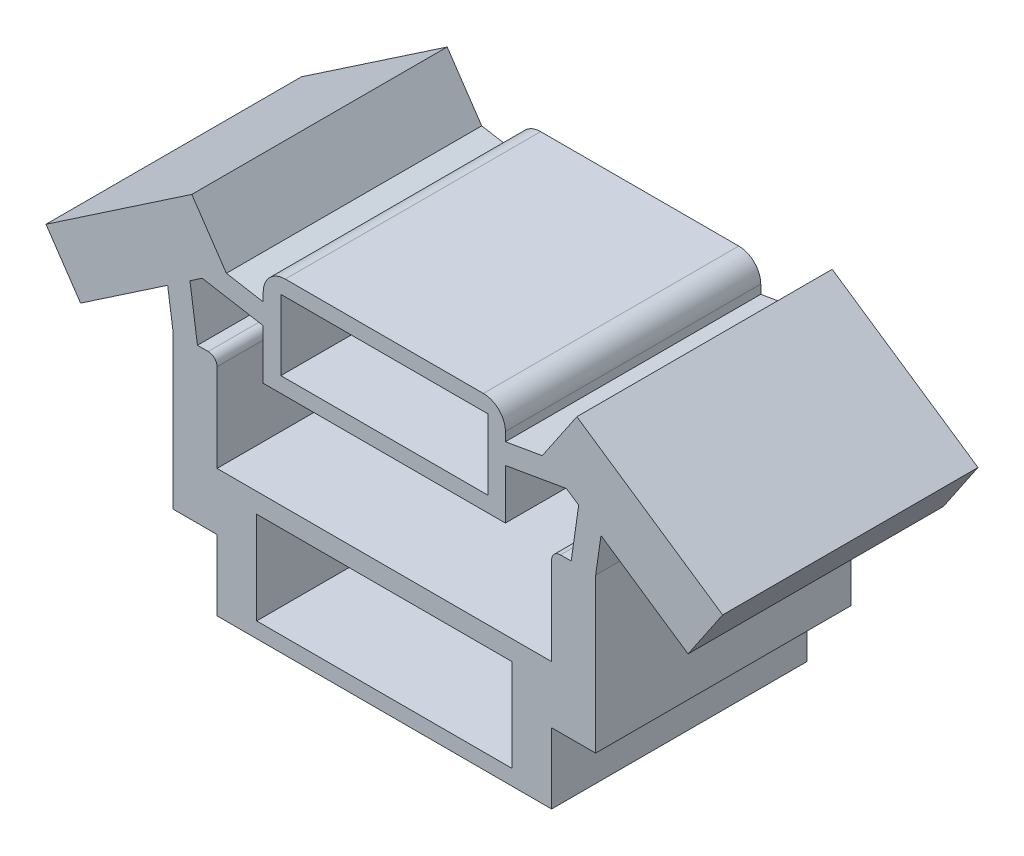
from build123d import *

# Parameters (mm, degrees)
EXTRUDE_1_DEPTH     = 5.8
SKETCH_10_W         = 5.8
SKETCH_10_H         = 2.1
SKETCH_10_W_2       = 4.7
SKETCH_10_H_2       = 1.6
CUT_EXTRUDE_3_DEPTH = 12.618551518
EXTRUDE_2_DEPTH     = 5.8
FILLET_1_R          = 0.5
SKETCH_12_W         = 5.8
SKETCH_12_H         = 0.1
SKETCH_12_W_2       = 7.6
EXTRUDE_3_DEPTH     = 5.8
SKETCH_14_W         = 5.8
SKETCH_14_H         = 0.1
CUT_EXTRUDE_4_DEPTH = 12.618551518
FILLET_2_R          = 0.2


with BuildPart() as part:
    # Sketch 1 → Extrude 1 (new body)
    with BuildSketch(Plane.XY):
        Polygon((2.75, 5.2), (3.587596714, 5.344678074), (4.372746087, 6.503790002), (7.684494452, 4.260506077), (6.899345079, 3.101394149), (4.921234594, 4.441309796), (4.8, 3.6), (4.8, 0.1), (3.8, 0.1), (3.8, -1.4), (-3.8, -1.4), (-3.8, 1.4), (3.8, 1.4), (3.8, 3.6), (4.244318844, 3.6), (4.414970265, 4.784238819), (4.136721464, 4.972716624), (2.75, 4.733188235), (2.75, 3.6), (-2.75, 3.6), (-2.75, 5.2), align=None)
    extrude_1 = extrude(amount=EXTRUDE_1_DEPTH)

    # Mirror 1: Extrude 1 across plane
    add(extrude_1.mirror(Plane(origin=(0, 0, 0), x_dir=(0, 0, 1), z_dir=(1, 0, 0))))

    # Sketch 10 → Cut-Extrude 3 (cut, through all)
    with BuildSketch(Plane.XY.offset(5.8)):
        Rectangle(SKETCH_10_W, SKETCH_10_H)
        with Locations((0, 4.75)):
            Rectangle(SKETCH_10_W_2, SKETCH_10_H_2)
    extrude(amount=-CUT_EXTRUDE_3_DEPTH, mode=Mode.SUBTRACT)

    # Sketch 11 → Extrude 2 (add)
    with BuildSketch(Plane.XY.offset(5.8)):
        Polygon((-2.35, 5.2), (-2.75, 5.2), (-2.75, 5.9), (2.75, 5.9), (2.75, 5.2), (2.35, 5.2), (2.35, 5.55), (-2.35, 5.55), align=None)
    extrude(amount=-EXTRUDE_2_DEPTH)

    # Fillet 1
    fillet_1_edges = [part.edges().sort_by_distance(p)[0] for p in [
        (2.75, 5.9, 2.9),
        (-2.75, 5.9, 2.9),
    ]]
    fillet(fillet_1_edges, radius=FILLET_1_R)

    # Sketch 12 → Extrude 3 (add)
    with BuildSketch(Plane.XY.offset(5.8)):
        with Locations((0, 1)):
            Rectangle(SKETCH_12_W, SKETCH_12_H)
        with Locations((0, -1.45)):
            Rectangle(SKETCH_12_W_2, SKETCH_12_H)
    extrude(amount=-EXTRUDE_3_DEPTH)

    # Sketch 14 → Cut-Extrude 4 (cut, through all)
    with BuildSketch(Plane.XY.offset(5.8)):
        with Locations((0, -1.1)):
            Rectangle(SKETCH_14_W, SKETCH_14_H)
    extrude(amount=-CUT_EXTRUDE_4_DEPTH, mode=Mode.SUBTRACT)

    # Fillet 2
    fillet_2_edges = [part.edges().sort_by_distance(p)[0] for p in [
        (3.8, 3.6, 2.9),
        (-3.8, 3.6, 2.9),
    ]]
    fillet(fillet_2_edges, radius=FILLET_2_R)


solid = part.part
